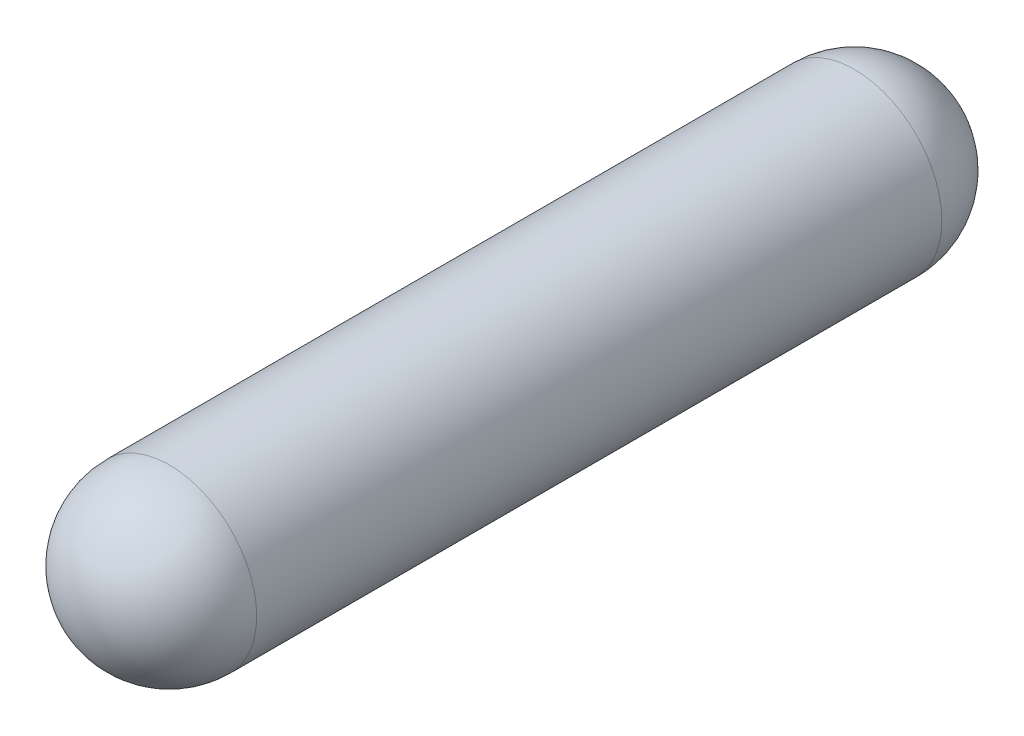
ISO-10303-21;
HEADER;
FILE_DESCRIPTION(('STEP AP214'),'2;1');
FILE_NAME('part.step','',(''),(''),'','','');
FILE_SCHEMA(('AUTOMOTIVE_DESIGN { 1 0 10303 214 1 1 1 1 }'));
ENDSEC;
DATA;
#1=APPLICATION_CONTEXT('core data for automotive mechanical design processes');
#2=APPLICATION_PROTOCOL_DEFINITION('international standard','automotive_design',2000,#1);
#3=PRODUCT_CONTEXT('',#1,'mechanical');
#4=PRODUCT('Part','Part','',(#3));
#5=PRODUCT_RELATED_PRODUCT_CATEGORY('part','',(#4));
#6=PRODUCT_DEFINITION_FORMATION('','',#4);
#7=PRODUCT_DEFINITION_CONTEXT('part definition',#1,'design');
#8=PRODUCT_DEFINITION('design','',#6,#7);
#9=PRODUCT_DEFINITION_SHAPE('','',#8);
#10=(LENGTH_UNIT() NAMED_UNIT(*) SI_UNIT(.MILLI.,.METRE.));
#11=(NAMED_UNIT(*) PLANE_ANGLE_UNIT() SI_UNIT($,.RADIAN.));
#12=(NAMED_UNIT(*) SI_UNIT($,.STERADIAN.) SOLID_ANGLE_UNIT());
#13=UNCERTAINTY_MEASURE_WITH_UNIT(LENGTH_MEASURE(1.E-05),#10,'distance_accuracy_value','');
#14=(GEOMETRIC_REPRESENTATION_CONTEXT(3) GLOBAL_UNCERTAINTY_ASSIGNED_CONTEXT((#13)) GLOBAL_UNIT_ASSIGNED_CONTEXT((#10,
#11,#12)) REPRESENTATION_CONTEXT('',''));
#15=CARTESIAN_POINT('',(0.,0.,0.));
#16=DIRECTION('',(0.,0.,1.));
#17=DIRECTION('',(1.,0.,0.));
#18=AXIS2_PLACEMENT_3D('',#15,#16,#17);
#19=CARTESIAN_POINT('',(0.,0.,6.223));
#20=DIRECTION('',(0.,0.,-1.));
#21=DIRECTION('',(-1.,0.,0.));
#22=AXIS2_PLACEMENT_3D('',#19,#20,#21);
#23=CYLINDRICAL_SURFACE('',#22,1.58750000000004);
#24=CARTESIAN_POINT('',(0.,0.,6.223));
#25=DIRECTION('',(0.,0.,1.));
#26=DIRECTION('',(1.,0.,0.));
#27=AXIS2_PLACEMENT_3D('',#24,#25,#26);
#28=CIRCLE('',#27,1.58750000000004);
#29=CARTESIAN_POINT('',(1.58750000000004,0.,6.223));
#30=VERTEX_POINT('',#29);
#31=EDGE_CURVE('E10',#30,#30,#28,.T.);
#32=ORIENTED_EDGE('',*,*,#31,.F.);
#33=EDGE_LOOP('',(#32));
#34=FACE_BOUND('',#33,.T.);
#35=CARTESIAN_POINT('',(0.,0.,-6.223));
#36=DIRECTION('',(0.,0.,1.));
#37=DIRECTION('',(1.,0.,0.));
#38=AXIS2_PLACEMENT_3D('',#35,#36,#37);
#39=CIRCLE('',#38,1.58750000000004);
#40=CARTESIAN_POINT('',(1.58750000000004,0.,-6.223));
#41=VERTEX_POINT('',#40);
#42=EDGE_CURVE('E38',#41,#41,#39,.T.);
#43=ORIENTED_EDGE('',*,*,#42,.T.);
#44=EDGE_LOOP('',(#43));
#45=FACE_BOUND('',#44,.T.);
#46=ADVANCED_FACE('F34',(#34,#45),#23,.T.);
#47=CARTESIAN_POINT('',(0.,0.,6.223));
#48=DIRECTION('',(0.,0.,1.));
#49=DIRECTION('',(1.,0.,0.));
#50=AXIS2_PLACEMENT_3D('',#47,#48,#49);
#51=SPHERICAL_SURFACE('',#50,1.58750000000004);
#52=ORIENTED_EDGE('',*,*,#31,.T.);
#53=EDGE_LOOP('',(#52));
#54=FACE_BOUND('',#53,.T.);
#55=ADVANCED_FACE('F49',(#54),#51,.T.);
#56=CARTESIAN_POINT('',(0.,0.,-6.223));
#57=DIRECTION('',(0.,0.,1.));
#58=DIRECTION('',(1.,0.,0.));
#59=AXIS2_PLACEMENT_3D('',#56,#57,#58);
#60=SPHERICAL_SURFACE('',#59,1.58750000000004);
#61=ORIENTED_EDGE('',*,*,#42,.F.);
#62=EDGE_LOOP('',(#61));
#63=FACE_BOUND('',#62,.T.);
#64=ADVANCED_FACE('F36',(#63),#60,.T.);
#65=CLOSED_SHELL('',(#46,#55,#64));
#66=MANIFOLD_SOLID_BREP('B2',#65);
#67=ADVANCED_BREP_SHAPE_REPRESENTATION('',(#18,#66),#14);
#68=SHAPE_DEFINITION_REPRESENTATION(#9,#67);
ENDSEC;
END-ISO-10303-21;
